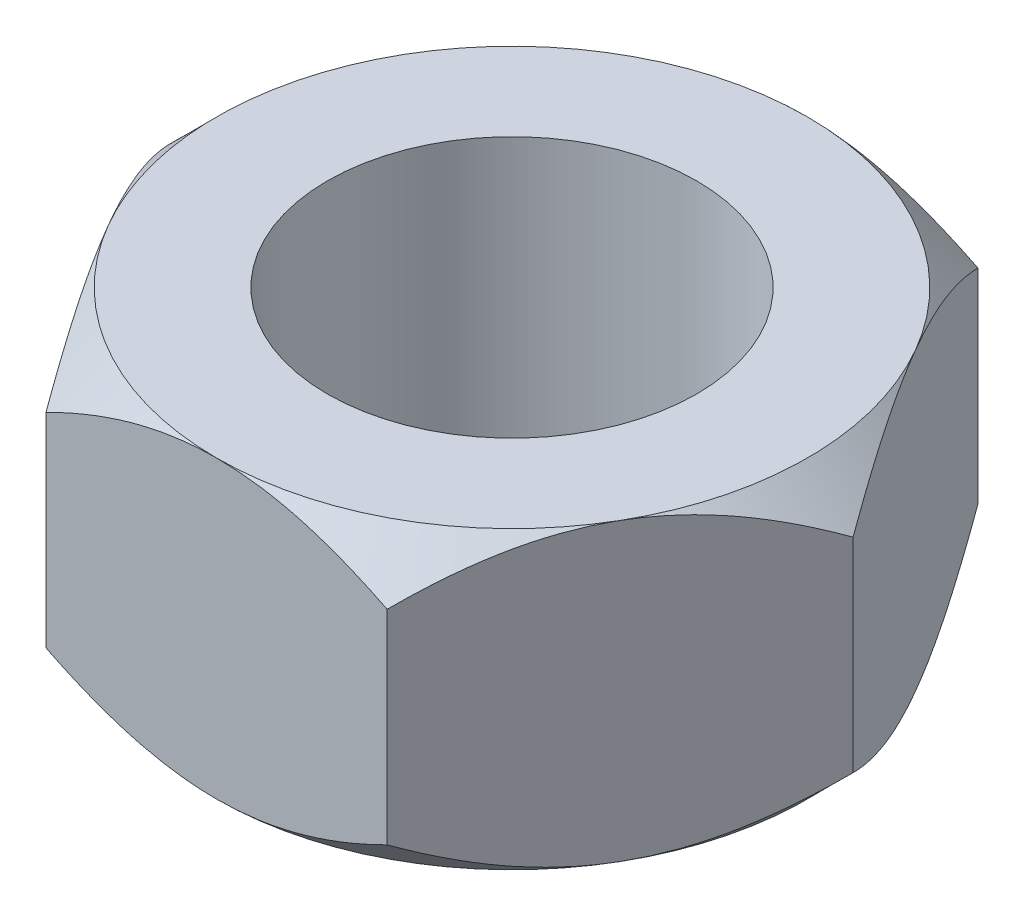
ISO-10303-21;
HEADER;
FILE_DESCRIPTION(('STEP AP214'),'2;1');
FILE_NAME('part.step','',(''),(''),'','','');
FILE_SCHEMA(('AUTOMOTIVE_DESIGN { 1 0 10303 214 1 1 1 1 }'));
ENDSEC;
DATA;
#1=APPLICATION_CONTEXT('core data for automotive mechanical design processes');
#2=APPLICATION_PROTOCOL_DEFINITION('international standard','automotive_design',2000,#1);
#3=PRODUCT_CONTEXT('',#1,'mechanical');
#4=PRODUCT('Part','Part','',(#3));
#5=PRODUCT_RELATED_PRODUCT_CATEGORY('part','',(#4));
#6=PRODUCT_DEFINITION_FORMATION('','',#4);
#7=PRODUCT_DEFINITION_CONTEXT('part definition',#1,'design');
#8=PRODUCT_DEFINITION('design','',#6,#7);
#9=PRODUCT_DEFINITION_SHAPE('','',#8);
#10=(LENGTH_UNIT() NAMED_UNIT(*) SI_UNIT(.MILLI.,.METRE.));
#11=(NAMED_UNIT(*) PLANE_ANGLE_UNIT() SI_UNIT($,.RADIAN.));
#12=(NAMED_UNIT(*) SI_UNIT($,.STERADIAN.) SOLID_ANGLE_UNIT());
#13=UNCERTAINTY_MEASURE_WITH_UNIT(LENGTH_MEASURE(1.E-05),#10,'distance_accuracy_value','');
#14=(GEOMETRIC_REPRESENTATION_CONTEXT(3) GLOBAL_UNCERTAINTY_ASSIGNED_CONTEXT((#13)) GLOBAL_UNIT_ASSIGNED_CONTEXT((#10,
#11,#12)) REPRESENTATION_CONTEXT('',''));
#15=CARTESIAN_POINT('',(0.,0.,0.));
#16=DIRECTION('',(0.,0.,1.));
#17=DIRECTION('',(1.,0.,0.));
#18=AXIS2_PLACEMENT_3D('',#15,#16,#17);
#19=CARTESIAN_POINT('',(4.61880215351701,4.,0.));
#20=DIRECTION('',(0.,-1.,0.));
#21=DIRECTION('',(0.,0.,-1.));
#22=AXIS2_PLACEMENT_3D('',#19,#20,#21);
#23=PLANE('',#22);
#24=CARTESIAN_POINT('',(0.,4.,0.));
#25=DIRECTION('',(0.,1.,0.));
#26=DIRECTION('',(0.,0.,1.));
#27=AXIS2_PLACEMENT_3D('',#24,#25,#26);
#28=CIRCLE('',#27,4.);
#29=CARTESIAN_POINT('',(3.46410161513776,4.,-2.));
#30=VERTEX_POINT('',#29);
#31=CARTESIAN_POINT('',(0.,4.,-4.));
#32=VERTEX_POINT('',#31);
#33=EDGE_CURVE('E291',#30,#32,#28,.T.);
#34=ORIENTED_EDGE('',*,*,#33,.T.);
#35=CARTESIAN_POINT('',(-3.46410161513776,4.,-2.));
#36=VERTEX_POINT('',#35);
#37=EDGE_CURVE('E295',#32,#36,#28,.T.);
#38=ORIENTED_EDGE('',*,*,#37,.T.);
#39=CARTESIAN_POINT('',(-3.46410161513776,4.,2.));
#40=VERTEX_POINT('',#39);
#41=EDGE_CURVE('E292',#36,#40,#28,.T.);
#42=ORIENTED_EDGE('',*,*,#41,.T.);
#43=CARTESIAN_POINT('',(0.,4.,4.));
#44=VERTEX_POINT('',#43);
#45=EDGE_CURVE('E156',#40,#44,#28,.T.);
#46=ORIENTED_EDGE('',*,*,#45,.T.);
#47=CARTESIAN_POINT('',(3.46410161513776,4.,2.));
#48=VERTEX_POINT('',#47);
#49=EDGE_CURVE('E283',#44,#48,#28,.T.);
#50=ORIENTED_EDGE('',*,*,#49,.T.);
#51=EDGE_CURVE('E285',#48,#30,#28,.T.);
#52=ORIENTED_EDGE('',*,*,#51,.T.);
#53=EDGE_LOOP('',(#34,#38,#42,#46,#50,#52));
#54=FACE_BOUND('',#53,.T.);
#55=CARTESIAN_POINT('',(0.,4.,0.));
#56=DIRECTION('',(0.,1.,0.));
#57=DIRECTION('',(0.,0.,1.));
#58=AXIS2_PLACEMENT_3D('',#55,#56,#57);
#59=CIRCLE('',#58,2.5);
#60=CARTESIAN_POINT('',(0.,4.,2.5));
#61=VERTEX_POINT('',#60);
#62=EDGE_CURVE('E186',#61,#61,#59,.T.);
#63=ORIENTED_EDGE('',*,*,#62,.F.);
#64=EDGE_LOOP('',(#63));
#65=FACE_BOUND('',#64,.T.);
#66=ADVANCED_FACE('F36',(#54,#65),#23,.F.);
#67=CARTESIAN_POINT('',(4.61880215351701,0.,0.));
#68=DIRECTION('',(0.,-1.,0.));
#69=DIRECTION('',(0.,0.,-1.));
#70=AXIS2_PLACEMENT_3D('',#67,#68,#69);
#71=PLANE('',#70);
#72=CARTESIAN_POINT('',(0.,0.,0.));
#73=DIRECTION('',(0.,-1.,0.));
#74=DIRECTION('',(0.,0.,-1.));
#75=AXIS2_PLACEMENT_3D('',#72,#73,#74);
#76=CIRCLE('',#75,4.00000000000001);
#77=CARTESIAN_POINT('',(-3.46410161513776,0.,-2.));
#78=VERTEX_POINT('',#77);
#79=CARTESIAN_POINT('',(0.,0.,-4.));
#80=VERTEX_POINT('',#79);
#81=EDGE_CURVE('E160',#78,#80,#76,.T.);
#82=ORIENTED_EDGE('',*,*,#81,.T.);
#83=CARTESIAN_POINT('',(3.46410161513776,0.,-2.));
#84=VERTEX_POINT('',#83);
#85=EDGE_CURVE('E138',#80,#84,#76,.T.);
#86=ORIENTED_EDGE('',*,*,#85,.T.);
#87=CARTESIAN_POINT('',(3.46410161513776,0.,2.));
#88=VERTEX_POINT('',#87);
#89=EDGE_CURVE('E129',#84,#88,#76,.T.);
#90=ORIENTED_EDGE('',*,*,#89,.T.);
#91=CARTESIAN_POINT('',(0.,0.,4.));
#92=VERTEX_POINT('',#91);
#93=EDGE_CURVE('E139',#88,#92,#76,.T.);
#94=ORIENTED_EDGE('',*,*,#93,.T.);
#95=CARTESIAN_POINT('',(-3.46410161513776,0.,2.));
#96=VERTEX_POINT('',#95);
#97=EDGE_CURVE('E166',#92,#96,#76,.T.);
#98=ORIENTED_EDGE('',*,*,#97,.T.);
#99=EDGE_CURVE('E165',#96,#78,#76,.T.);
#100=ORIENTED_EDGE('',*,*,#99,.T.);
#101=EDGE_LOOP('',(#82,#86,#90,#94,#98,#100));
#102=FACE_BOUND('',#101,.T.);
#103=CARTESIAN_POINT('',(0.,0.,0.));
#104=DIRECTION('',(0.,1.,0.));
#105=DIRECTION('',(0.,0.,1.));
#106=AXIS2_PLACEMENT_3D('',#103,#104,#105);
#107=CIRCLE('',#106,2.5);
#108=CARTESIAN_POINT('',(0.,0.,2.5));
#109=VERTEX_POINT('',#108);
#110=EDGE_CURVE('E191',#109,#109,#107,.T.);
#111=ORIENTED_EDGE('',*,*,#110,.T.);
#112=EDGE_LOOP('',(#111));
#113=FACE_BOUND('',#112,.T.);
#114=ADVANCED_FACE('F157',(#102,#113),#71,.T.);
#115=CARTESIAN_POINT('',(4.61880215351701,4.,0.));
#116=DIRECTION('',(0.866025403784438,0.,0.500000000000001));
#117=DIRECTION('',(0.500000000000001,0.,-0.866025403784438));
#118=AXIS2_PLACEMENT_3D('',#115,#116,#117);
#119=PLANE('',#118);
#120=DIRECTION('',(0.,-1.,0.));
#121=VECTOR('',#120,1.);
#122=CARTESIAN_POINT('',(2.30940107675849,4.,4.));
#123=LINE('',#122,#121);
#124=CARTESIAN_POINT('',(2.30940107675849,3.381197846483,4.));
#125=VERTEX_POINT('',#124);
#126=CARTESIAN_POINT('',(2.30940107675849,0.618802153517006,4.));
#127=VERTEX_POINT('',#126);
#128=EDGE_CURVE('E178',#125,#127,#123,.T.);
#129=ORIENTED_EDGE('',*,*,#128,.T.);
#130=CARTESIAN_POINT('',(2.30928560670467,0.618917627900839,4.00020000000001));
#131=CARTESIAN_POINT('',(2.34899632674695,0.579211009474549,3.93141901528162));
#132=CARTESIAN_POINT('',(2.3890109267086,0.540722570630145,3.8621116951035));
#133=CARTESIAN_POINT('',(2.46971048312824,0.466553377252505,3.72233596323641));
#134=CARTESIAN_POINT('',(2.51039579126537,0.430874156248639,3.6518669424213));
#135=CARTESIAN_POINT('',(2.63392971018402,0.32830302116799,3.4378999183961));
#136=CARTESIAN_POINT('',(2.71782823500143,0.266315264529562,3.29258341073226));
#137=CARTESIAN_POINT('',(2.88698352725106,0.160158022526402,2.99959785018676));
#138=CARTESIAN_POINT('',(2.97219756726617,0.11572120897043,2.85200280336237));
#139=CARTESIAN_POINT('',(3.14450730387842,0.0472511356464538,2.55355358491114));
#140=CARTESIAN_POINT('',(3.23159772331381,0.0231667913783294,2.40270855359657));
#141=CARTESIAN_POINT('',(3.38169462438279,0.00143703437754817,2.14273309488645));
#142=CARTESIAN_POINT('',(3.44450772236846,-0.00177893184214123,2.03393761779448));
#143=CARTESIAN_POINT('',(3.57003196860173,0.00364221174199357,1.81652324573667));
#144=CARTESIAN_POINT('',(3.63274307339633,0.0122834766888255,1.70790442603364));
#145=CARTESIAN_POINT('',(3.75757108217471,0.040926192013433,1.49169597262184));
#146=CARTESIAN_POINT('',(3.81968724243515,0.0609403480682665,1.38410762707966));
#147=CARTESIAN_POINT('',(3.94285275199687,0.111236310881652,1.17077870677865));
#148=CARTESIAN_POINT('',(4.00390218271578,0.141517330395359,1.06503799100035));
#149=CARTESIAN_POINT('',(4.11227961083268,0.20381740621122,0.877322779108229));
#150=CARTESIAN_POINT('',(4.1598475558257,0.234198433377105,0.794932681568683));
#151=CARTESIAN_POINT('',(4.25412951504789,0.299856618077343,0.631631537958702));
#152=CARTESIAN_POINT('',(4.30084350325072,0.335133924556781,0.550720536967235));
#153=CARTESIAN_POINT('',(4.39327037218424,0.409793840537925,0.390632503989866));
#154=CARTESIAN_POINT('',(4.43898588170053,0.449163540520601,0.311450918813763));
#155=CARTESIAN_POINT('',(4.52957030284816,0.531491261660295,0.154554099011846));
#156=CARTESIAN_POINT('',(4.57443971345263,0.574447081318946,0.0768380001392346));
#157=CARTESIAN_POINT('',(4.61891762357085,0.618917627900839,-0.000200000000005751));
#158=B_SPLINE_CURVE_WITH_KNOTS('',3,(#130,#131,#132,#133,#134,#135,#136,#137,#138,#139,#140,
#141,#142,#143,#144,#145,#146,#147,#148,#149,#150,#151,#152,#153,#154,#155,#156,#157),
.UNSPECIFIED.,.F.,.F.,(4,2,2,2,2,2,2,2,2,2,2,2,2,4),(0.,0.266361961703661,0.532868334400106,
1.06875865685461,1.59613884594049,2.12219135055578,2.49866160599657,2.87526382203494,
3.25228760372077,3.62928248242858,3.92874944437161,4.22822551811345,4.52678401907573,
4.82516056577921),.UNSPECIFIED.);
#159=EDGE_CURVE('E163',#127,#88,#158,.T.);
#160=ORIENTED_EDGE('',*,*,#159,.T.);
#161=CARTESIAN_POINT('',(4.61880215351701,0.618802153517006,0.));
#162=VERTEX_POINT('',#161);
#163=EDGE_CURVE('E57',#88,#162,#158,.T.);
#164=ORIENTED_EDGE('',*,*,#163,.T.);
#165=DIRECTION('',(0.,-1.,0.));
#166=VECTOR('',#165,1.);
#167=CARTESIAN_POINT('',(4.61880215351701,4.,0.));
#168=LINE('',#167,#166);
#169=CARTESIAN_POINT('',(4.61880215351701,3.381197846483,0.));
#170=VERTEX_POINT('',#169);
#171=EDGE_CURVE('E155',#170,#162,#168,.T.);
#172=ORIENTED_EDGE('',*,*,#171,.F.);
#173=CARTESIAN_POINT('',(4.61891762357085,3.38108237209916,-0.000200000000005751));
#174=CARTESIAN_POINT('',(4.57920690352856,3.42078899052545,0.0685809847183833));
#175=CARTESIAN_POINT('',(4.53919230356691,3.45927742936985,0.137888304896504));
#176=CARTESIAN_POINT('',(4.45849274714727,3.53344662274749,0.277664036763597));
#177=CARTESIAN_POINT('',(4.41780743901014,3.56912584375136,0.348133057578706));
#178=CARTESIAN_POINT('',(4.29427352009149,3.67169697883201,0.5621000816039));
#179=CARTESIAN_POINT('',(4.21037499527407,3.73368473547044,0.70741658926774));
#180=CARTESIAN_POINT('',(4.04121970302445,3.8398419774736,1.00040214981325));
#181=CARTESIAN_POINT('',(3.95600566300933,3.88427879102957,1.14799719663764));
#182=CARTESIAN_POINT('',(3.78369592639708,3.95274886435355,1.44644641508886));
#183=CARTESIAN_POINT('',(3.6966055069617,3.97683320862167,1.59729144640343));
#184=CARTESIAN_POINT('',(3.54650860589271,3.99856296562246,1.85726690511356));
#185=CARTESIAN_POINT('',(3.48369550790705,4.00177893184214,1.96606238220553));
#186=CARTESIAN_POINT('',(3.35817126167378,3.99635778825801,2.18347675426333));
#187=CARTESIAN_POINT('',(3.29546015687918,3.98771652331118,2.29209557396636));
#188=CARTESIAN_POINT('',(3.1706321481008,3.95907380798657,2.50830402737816));
#189=CARTESIAN_POINT('',(3.10851598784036,3.93905965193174,2.61589237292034));
#190=CARTESIAN_POINT('',(2.98535047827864,3.88876368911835,2.82922129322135));
#191=CARTESIAN_POINT('',(2.92430104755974,3.85848266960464,2.93496200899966));
#192=CARTESIAN_POINT('',(2.81592361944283,3.79618259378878,3.12267722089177));
#193=CARTESIAN_POINT('',(2.76835567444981,3.7658015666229,3.20506731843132));
#194=CARTESIAN_POINT('',(2.67407371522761,3.70014338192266,3.3683684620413));
#195=CARTESIAN_POINT('',(2.62735972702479,3.66486607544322,3.44927946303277));
#196=CARTESIAN_POINT('',(2.53493285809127,3.59020615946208,3.60936749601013));
#197=CARTESIAN_POINT('',(2.48921734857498,3.55083645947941,3.68854908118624));
#198=CARTESIAN_POINT('',(2.39863292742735,3.46850873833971,3.84544590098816));
#199=CARTESIAN_POINT('',(2.35376351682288,3.42555291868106,3.92316199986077));
#200=CARTESIAN_POINT('',(2.30928560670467,3.38108237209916,4.00020000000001));
#201=B_SPLINE_CURVE_WITH_KNOTS('',3,(#173,#174,#175,#176,#177,#178,#179,#180,#181,#182,#183,
#184,#185,#186,#187,#188,#189,#190,#191,#192,#193,#194,#195,#196,#197,#198,#199,#200),
.UNSPECIFIED.,.F.,.F.,(4,2,2,2,2,2,2,2,2,2,2,2,2,4),(0.,0.266361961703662,0.532868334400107,
1.06875865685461,1.59613884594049,2.12219135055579,2.49866160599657,2.87526382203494,
3.25228760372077,3.62928248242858,3.92874944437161,4.22822551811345,4.52678401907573,
4.82516056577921),.UNSPECIFIED.);
#202=EDGE_CURVE('E327',#170,#48,#201,.T.);
#203=ORIENTED_EDGE('',*,*,#202,.T.);
#204=EDGE_CURVE('E183',#48,#125,#201,.T.);
#205=ORIENTED_EDGE('',*,*,#204,.T.);
#206=EDGE_LOOP('',(#129,#160,#164,#172,#203,#205));
#207=FACE_BOUND('',#206,.T.);
#208=ADVANCED_FACE('F38',(#207),#119,.T.);
#209=CARTESIAN_POINT('',(4.61880215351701,4.,0.));
#210=DIRECTION('',(-0.866025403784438,0.,0.500000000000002));
#211=DIRECTION('',(0.500000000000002,0.,0.866025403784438));
#212=AXIS2_PLACEMENT_3D('',#209,#210,#211);
#213=PLANE('',#212);
#214=CARTESIAN_POINT('',(2.30928560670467,0.618917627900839,-4.00020000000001));
#215=CARTESIAN_POINT('',(2.34899632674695,0.579211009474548,-3.93141901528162));
#216=CARTESIAN_POINT('',(2.3890109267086,0.540722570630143,-3.8621116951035));
#217=CARTESIAN_POINT('',(2.46971048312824,0.466553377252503,-3.72233596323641));
#218=CARTESIAN_POINT('',(2.51039579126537,0.430874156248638,-3.6518669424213));
#219=CARTESIAN_POINT('',(2.63392971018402,0.328303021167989,-3.4378999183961));
#220=CARTESIAN_POINT('',(2.71782823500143,0.266315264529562,-3.29258341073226));
#221=CARTESIAN_POINT('',(2.88698352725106,0.160158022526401,-2.99959785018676));
#222=CARTESIAN_POINT('',(2.97219756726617,0.115721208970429,-2.85200280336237));
#223=CARTESIAN_POINT('',(3.14450730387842,0.047251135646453,-2.55355358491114));
#224=CARTESIAN_POINT('',(3.23159772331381,0.0231667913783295,-2.40270855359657));
#225=CARTESIAN_POINT('',(3.38169462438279,0.00143703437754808,-2.14273309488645));
#226=CARTESIAN_POINT('',(3.44450772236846,-0.00177893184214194,-2.03393761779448));
#227=CARTESIAN_POINT('',(3.57003196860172,0.00364221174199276,-1.81652324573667));
#228=CARTESIAN_POINT('',(3.63274307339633,0.0122834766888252,-1.70790442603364));
#229=CARTESIAN_POINT('',(3.75757108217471,0.0409261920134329,-1.49169597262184));
#230=CARTESIAN_POINT('',(3.81968724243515,0.0609403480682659,-1.38410762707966));
#231=CARTESIAN_POINT('',(3.94285275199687,0.111236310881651,-1.17077870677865));
#232=CARTESIAN_POINT('',(4.00390218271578,0.141517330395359,-1.06503799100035));
#233=CARTESIAN_POINT('',(4.11227961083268,0.20381740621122,-0.877322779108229));
#234=CARTESIAN_POINT('',(4.1598475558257,0.234198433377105,-0.794932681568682));
#235=CARTESIAN_POINT('',(4.25412951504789,0.299856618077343,-0.631631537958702));
#236=CARTESIAN_POINT('',(4.30084350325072,0.335133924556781,-0.550720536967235));
#237=CARTESIAN_POINT('',(4.39327037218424,0.409793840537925,-0.390632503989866));
#238=CARTESIAN_POINT('',(4.43898588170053,0.449163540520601,-0.311450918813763));
#239=CARTESIAN_POINT('',(4.52957030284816,0.531491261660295,-0.154554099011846));
#240=CARTESIAN_POINT('',(4.57443971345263,0.574447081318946,-0.0768380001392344));
#241=CARTESIAN_POINT('',(4.61891762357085,0.618917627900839,0.000200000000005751));
#242=B_SPLINE_CURVE_WITH_KNOTS('',3,(#214,#215,#216,#217,#218,#219,#220,#221,#222,#223,#224,
#225,#226,#227,#228,#229,#230,#231,#232,#233,#234,#235,#236,#237,#238,#239,#240,#241),
.UNSPECIFIED.,.F.,.F.,(4,2,2,2,2,2,2,2,2,2,2,2,2,4),(0.,0.266361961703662,0.532868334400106,
1.06875865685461,1.59613884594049,2.12219135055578,2.49866160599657,2.87526382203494,
3.25228760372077,3.62928248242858,3.92874944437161,4.22822551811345,4.52678401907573,
4.82516056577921),.UNSPECIFIED.);
#243=CARTESIAN_POINT('',(2.30940107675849,0.618802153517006,-4.));
#244=VERTEX_POINT('',#243);
#245=EDGE_CURVE('E144',#244,#84,#242,.T.);
#246=ORIENTED_EDGE('',*,*,#245,.F.);
#247=DIRECTION('',(0.,-1.,0.));
#248=VECTOR('',#247,1.);
#249=CARTESIAN_POINT('',(2.30940107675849,4.,-4.));
#250=LINE('',#249,#248);
#251=CARTESIAN_POINT('',(2.30940107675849,3.381197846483,-4.));
#252=VERTEX_POINT('',#251);
#253=EDGE_CURVE('E317',#252,#244,#250,.T.);
#254=ORIENTED_EDGE('',*,*,#253,.F.);
#255=CARTESIAN_POINT('',(4.61891762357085,3.38108237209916,0.000200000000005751));
#256=CARTESIAN_POINT('',(4.57920690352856,3.42078899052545,-0.0685809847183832));
#257=CARTESIAN_POINT('',(4.53919230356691,3.45927742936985,-0.137888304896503));
#258=CARTESIAN_POINT('',(4.45849274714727,3.53344662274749,-0.277664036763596));
#259=CARTESIAN_POINT('',(4.41780743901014,3.56912584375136,-0.348133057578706));
#260=CARTESIAN_POINT('',(4.29427352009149,3.67169697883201,-0.5621000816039));
#261=CARTESIAN_POINT('',(4.21037499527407,3.73368473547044,-0.70741658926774));
#262=CARTESIAN_POINT('',(4.04121970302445,3.8398419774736,-1.00040214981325));
#263=CARTESIAN_POINT('',(3.95600566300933,3.88427879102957,-1.14799719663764));
#264=CARTESIAN_POINT('',(3.78369592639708,3.95274886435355,-1.44644641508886));
#265=CARTESIAN_POINT('',(3.6966055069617,3.97683320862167,-1.59729144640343));
#266=CARTESIAN_POINT('',(3.54650860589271,3.99856296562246,-1.85726690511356));
#267=CARTESIAN_POINT('',(3.48369550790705,4.00177893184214,-1.96606238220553));
#268=CARTESIAN_POINT('',(3.35817126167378,3.99635778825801,-2.18347675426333));
#269=CARTESIAN_POINT('',(3.29546015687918,3.98771652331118,-2.29209557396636));
#270=CARTESIAN_POINT('',(3.1706321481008,3.95907380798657,-2.50830402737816));
#271=CARTESIAN_POINT('',(3.10851598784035,3.93905965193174,-2.61589237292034));
#272=CARTESIAN_POINT('',(2.98535047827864,3.88876368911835,-2.82922129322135));
#273=CARTESIAN_POINT('',(2.92430104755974,3.85848266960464,-2.93496200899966));
#274=CARTESIAN_POINT('',(2.81592361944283,3.79618259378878,-3.12267722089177));
#275=CARTESIAN_POINT('',(2.76835567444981,3.7658015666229,-3.20506731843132));
#276=CARTESIAN_POINT('',(2.67407371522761,3.70014338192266,-3.3683684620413));
#277=CARTESIAN_POINT('',(2.62735972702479,3.66486607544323,-3.44927946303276));
#278=CARTESIAN_POINT('',(2.53493285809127,3.59020615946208,-3.60936749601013));
#279=CARTESIAN_POINT('',(2.48921734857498,3.55083645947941,-3.68854908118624));
#280=CARTESIAN_POINT('',(2.39863292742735,3.46850873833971,-3.84544590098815));
#281=CARTESIAN_POINT('',(2.35376351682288,3.42555291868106,-3.92316199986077));
#282=CARTESIAN_POINT('',(2.30928560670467,3.38108237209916,-4.00020000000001));
#283=B_SPLINE_CURVE_WITH_KNOTS('',3,(#255,#256,#257,#258,#259,#260,#261,#262,#263,#264,#265,
#266,#267,#268,#269,#270,#271,#272,#273,#274,#275,#276,#277,#278,#279,#280,#281,#282),
.UNSPECIFIED.,.F.,.F.,(4,2,2,2,2,2,2,2,2,2,2,2,2,4),(0.,0.266361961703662,0.532868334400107,
1.06875865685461,1.59613884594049,2.12219135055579,2.49866160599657,2.87526382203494,
3.25228760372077,3.62928248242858,3.92874944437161,4.22822551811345,4.52678401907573,
4.82516056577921),.UNSPECIFIED.);
#284=EDGE_CURVE('E310',#30,#252,#283,.T.);
#285=ORIENTED_EDGE('',*,*,#284,.F.);
#286=EDGE_CURVE('E247',#170,#30,#283,.T.);
#287=ORIENTED_EDGE('',*,*,#286,.F.);
#288=ORIENTED_EDGE('',*,*,#171,.T.);
#289=EDGE_CURVE('E133',#84,#162,#242,.T.);
#290=ORIENTED_EDGE('',*,*,#289,.F.);
#291=EDGE_LOOP('',(#246,#254,#285,#287,#288,#290));
#292=FACE_BOUND('',#291,.T.);
#293=ADVANCED_FACE('F153',(#292),#213,.F.);
#294=CARTESIAN_POINT('',(-2.30940107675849,4.,-4.));
#295=DIRECTION('',(0.,0.,-1.));
#296=DIRECTION('',(-1.,0.,0.));
#297=AXIS2_PLACEMENT_3D('',#294,#295,#296);
#298=PLANE('',#297);
#299=ORIENTED_EDGE('',*,*,#253,.T.);
#300=CARTESIAN_POINT('',(-5.62739378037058,2.9041698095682,-4.));
#301=CARTESIAN_POINT('',(-5.48567305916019,2.78868679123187,-4.));
#302=CARTESIAN_POINT('',(-5.34325635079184,2.67404423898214,-4.));
#303=CARTESIAN_POINT('',(-5.05668167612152,2.44688221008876,-4.));
#304=CARTESIAN_POINT('',(-4.91252327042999,2.33436328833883,-4.));
#305=CARTESIAN_POINT('',(-4.62060451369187,2.11073714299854,-4.));
#306=CARTESIAN_POINT('',(-4.47282202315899,1.99965872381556,-4.));
#307=CARTESIAN_POINT('',(-4.1747891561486,1.780883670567,-4.));
#308=CARTESIAN_POINT('',(-4.0245390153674,1.67318671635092,-4.));
#309=CARTESIAN_POINT('',(-3.70745510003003,1.45262266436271,-4.));
#310=CARTESIAN_POINT('',(-3.54034108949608,1.34015614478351,-4.));
#311=CARTESIAN_POINT('',(-3.20168901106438,1.12191677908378,-4.));
#312=CARTESIAN_POINT('',(-3.03014957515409,1.01614603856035,-4.));
#313=CARTESIAN_POINT('',(-2.68253937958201,0.814154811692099,-4.));
#314=CARTESIAN_POINT('',(-2.50649297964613,0.717892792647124,-4.));
#315=CARTESIAN_POINT('',(-2.14824323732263,0.537730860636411,-4.));
#316=CARTESIAN_POINT('',(-1.9660452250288,0.453820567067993,-4.));
#317=CARTESIAN_POINT('',(-1.64622345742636,0.323778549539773,-4.));
#318=CARTESIAN_POINT('',(-1.51024779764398,0.273622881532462,-4.));
#319=CARTESIAN_POINT('',(-1.23468247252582,0.184192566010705,-4.));
#320=CARTESIAN_POINT('',(-1.09509231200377,0.14491941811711,-4.));
#321=CARTESIAN_POINT('',(-0.815895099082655,0.0801558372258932,-4.));
#322=CARTESIAN_POINT('',(-0.676354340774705,0.0543844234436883,-4.));
#323=CARTESIAN_POINT('',(-0.395369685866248,0.0170833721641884,-4.));
#324=CARTESIAN_POINT('',(-0.25392622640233,0.0055505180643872,-4.));
#325=CARTESIAN_POINT('',(0.0224344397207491,-0.00220491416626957,-4.));
#326=CARTESIAN_POINT('',(0.157331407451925,0.000849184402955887,-4.));
#327=CARTESIAN_POINT('',(0.426139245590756,0.0203999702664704,-4.));
#328=CARTESIAN_POINT('',(0.560050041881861,0.0368976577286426,-4.));
#329=CARTESIAN_POINT('',(0.828249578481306,0.082669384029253,-4.));
#330=CARTESIAN_POINT('',(0.962497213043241,0.112180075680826,-4.));
#331=CARTESIAN_POINT('',(1.22800919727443,0.182295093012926,-4.));
#332=CARTESIAN_POINT('',(1.35927363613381,0.222899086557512,-4.));
#333=CARTESIAN_POINT('',(1.62314822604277,0.31494728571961,-4.));
#334=CARTESIAN_POINT('',(1.75564045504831,0.366725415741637,-4.));
#335=CARTESIAN_POINT('',(2.01721504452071,0.478297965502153,-4.));
#336=CARTESIAN_POINT('',(2.14629632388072,0.538094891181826,-4.));
#337=CARTESIAN_POINT('',(2.40167335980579,0.664297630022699,-4.));
#338=CARTESIAN_POINT('',(2.52795890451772,0.730723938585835,-4.));
#339=CARTESIAN_POINT('',(2.77764203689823,0.868724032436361,-4.));
#340=CARTESIAN_POINT('',(2.9010400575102,0.94029703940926,-4.));
#341=CARTESIAN_POINT('',(3.13927957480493,1.08394545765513,-4.));
#342=CARTESIAN_POINT('',(3.25424234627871,1.15582080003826,-4.));
#343=CARTESIAN_POINT('',(3.4821925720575,1.30264731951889,-4.));
#344=CARTESIAN_POINT('',(3.59517987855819,1.377598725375,-4.));
#345=CARTESIAN_POINT('',(3.81853437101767,1.52942464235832,-4.));
#346=CARTESIAN_POINT('',(3.92891526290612,1.60627906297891,-4.));
#347=CARTESIAN_POINT('',(4.14816043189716,1.76206082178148,-4.));
#348=CARTESIAN_POINT('',(4.25702511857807,1.8409875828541,-4.));
#349=CARTESIAN_POINT('',(4.36525322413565,1.9207631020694,-4.));
#350=B_SPLINE_CURVE_WITH_KNOTS('',3,(#300,#301,#302,#303,#304,#305,#306,#307,#308,#309,#310,
#311,#312,#313,#314,#315,#316,#317,#318,#319,#320,#321,#322,#323,#324,#325,#326,#327,#328,#329,
#330,#331,#332,#333,#334,#335,#336,#337,#338,#339,#340,#341,#342,#343,#344,#345,#346,#347,#348,
#349),.UNSPECIFIED.,.F.,.F.,(4,2,2,2,2,2,2,2,2,2,2,2,2,2,2,2,2,2,2,2,2,2,2,2,4),(0.,
0.548452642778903,1.09704666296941,1.65162724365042,2.20615515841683,2.81033793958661,
3.41470978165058,4.01631281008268,4.61740731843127,5.05183569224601,5.48632390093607,
5.91136971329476,6.33631948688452,6.74042244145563,7.14455546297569,7.55636228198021,
7.9681567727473,8.39458384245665,8.82114448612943,9.24906733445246,9.67692560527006,
10.0836145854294,10.4903338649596,10.8938112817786,11.2971775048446),.UNSPECIFIED.);
#351=EDGE_CURVE('E147',#244,#80,#350,.F.);
#352=ORIENTED_EDGE('',*,*,#351,.T.);
#353=CARTESIAN_POINT('',(-2.30940107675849,0.618802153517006,-4.));
#354=VERTEX_POINT('',#353);
#355=EDGE_CURVE('E265',#80,#354,#350,.F.);
#356=ORIENTED_EDGE('',*,*,#355,.T.);
#357=DIRECTION('',(0.,-1.,0.));
#358=VECTOR('',#357,1.);
#359=CARTESIAN_POINT('',(-2.30940107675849,4.,-4.));
#360=LINE('',#359,#358);
#361=CARTESIAN_POINT('',(-2.30940107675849,3.381197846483,-4.));
#362=VERTEX_POINT('',#361);
#363=EDGE_CURVE('E313',#362,#354,#360,.T.);
#364=ORIENTED_EDGE('',*,*,#363,.F.);
#365=CARTESIAN_POINT('',(-5.62739378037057,1.0958301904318,-4.));
#366=CARTESIAN_POINT('',(-5.48567305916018,1.21131320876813,-4.));
#367=CARTESIAN_POINT('',(-5.34325635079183,1.32595576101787,-4.));
#368=CARTESIAN_POINT('',(-5.05668167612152,1.55311778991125,-4.));
#369=CARTESIAN_POINT('',(-4.91252327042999,1.66563671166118,-4.));
#370=CARTESIAN_POINT('',(-4.62060451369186,1.88926285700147,-4.));
#371=CARTESIAN_POINT('',(-4.47282202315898,2.00034127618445,-4.));
#372=CARTESIAN_POINT('',(-4.1747891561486,2.21911632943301,-4.));
#373=CARTESIAN_POINT('',(-4.02453901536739,2.32681328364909,-4.));
#374=CARTESIAN_POINT('',(-3.70745510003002,2.54737733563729,-4.));
#375=CARTESIAN_POINT('',(-3.54034108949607,2.65984385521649,-4.));
#376=CARTESIAN_POINT('',(-3.20168901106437,2.87808322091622,-4.));
#377=CARTESIAN_POINT('',(-3.03014957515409,2.98385396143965,-4.));
#378=CARTESIAN_POINT('',(-2.68253937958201,3.18584518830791,-4.));
#379=CARTESIAN_POINT('',(-2.50649297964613,3.28210720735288,-4.));
#380=CARTESIAN_POINT('',(-2.14824323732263,3.46226913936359,-4.));
#381=CARTESIAN_POINT('',(-1.9660452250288,3.54617943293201,-4.));
#382=CARTESIAN_POINT('',(-1.64622345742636,3.67622145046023,-4.));
#383=CARTESIAN_POINT('',(-1.51024779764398,3.72637711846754,-4.));
#384=CARTESIAN_POINT('',(-1.23468247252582,3.8158074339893,-4.));
#385=CARTESIAN_POINT('',(-1.09509231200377,3.85508058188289,-4.));
#386=CARTESIAN_POINT('',(-0.815895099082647,3.91984416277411,-4.));
#387=CARTESIAN_POINT('',(-0.676354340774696,3.94561557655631,-4.));
#388=CARTESIAN_POINT('',(-0.395369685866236,3.98291662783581,-4.));
#389=CARTESIAN_POINT('',(-0.253926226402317,3.99444948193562,-4.));
#390=CARTESIAN_POINT('',(0.0224344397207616,4.00220491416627,-4.));
#391=CARTESIAN_POINT('',(0.157331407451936,3.99915081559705,-4.));
#392=CARTESIAN_POINT('',(0.426139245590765,3.97960002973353,-4.));
#393=CARTESIAN_POINT('',(0.560050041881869,3.96310234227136,-4.));
#394=CARTESIAN_POINT('',(0.828249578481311,3.91733061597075,-4.));
#395=CARTESIAN_POINT('',(0.962497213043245,3.88781992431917,-4.));
#396=CARTESIAN_POINT('',(1.22800919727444,3.81770490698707,-4.));
#397=CARTESIAN_POINT('',(1.35927363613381,3.77710091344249,-4.));
#398=CARTESIAN_POINT('',(1.62314822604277,3.68505271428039,-4.));
#399=CARTESIAN_POINT('',(1.75564045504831,3.63327458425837,-4.));
#400=CARTESIAN_POINT('',(2.01721504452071,3.52170203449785,-4.));
#401=CARTESIAN_POINT('',(2.14629632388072,3.46190510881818,-4.));
#402=CARTESIAN_POINT('',(2.4016733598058,3.3357023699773,-4.));
#403=CARTESIAN_POINT('',(2.52795890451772,3.26927606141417,-4.));
#404=CARTESIAN_POINT('',(2.77764203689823,3.13127596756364,-4.));
#405=CARTESIAN_POINT('',(2.9010400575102,3.05970296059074,-4.));
#406=CARTESIAN_POINT('',(3.13927957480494,2.91605454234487,-4.));
#407=CARTESIAN_POINT('',(3.25424234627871,2.84417919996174,-4.));
#408=CARTESIAN_POINT('',(3.4821925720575,2.69735268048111,-4.));
#409=CARTESIAN_POINT('',(3.59517987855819,2.622401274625,-4.));
#410=CARTESIAN_POINT('',(3.81853437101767,2.47057535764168,-4.));
#411=CARTESIAN_POINT('',(3.92891526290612,2.39372093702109,-4.));
#412=CARTESIAN_POINT('',(4.14816043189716,2.23793917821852,-4.));
#413=CARTESIAN_POINT('',(4.25702511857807,2.1590124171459,-4.));
#414=CARTESIAN_POINT('',(4.36525322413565,2.0792368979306,-4.));
#415=B_SPLINE_CURVE_WITH_KNOTS('',3,(#365,#366,#367,#368,#369,#370,#371,#372,#373,#374,#375,
#376,#377,#378,#379,#380,#381,#382,#383,#384,#385,#386,#387,#388,#389,#390,#391,#392,#393,#394,
#395,#396,#397,#398,#399,#400,#401,#402,#403,#404,#405,#406,#407,#408,#409,#410,#411,#412,#413,
#414),.UNSPECIFIED.,.F.,.F.,(4,2,2,2,2,2,2,2,2,2,2,2,2,2,2,2,2,2,2,2,2,2,2,2,4),(0.,
0.548452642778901,1.09704666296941,1.65162724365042,2.20615515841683,2.8103379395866,
3.41470978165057,4.01631281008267,4.61740731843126,5.051835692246,5.48632390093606,
5.91136971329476,6.33631948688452,6.74042244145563,7.14455546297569,7.5563622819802,
7.96815677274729,8.39458384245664,8.82114448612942,9.24906733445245,9.67692560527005,
10.0836145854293,10.4903338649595,10.8938112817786,11.2971775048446),.UNSPECIFIED.);
#416=EDGE_CURVE('E240',#362,#32,#415,.T.);
#417=ORIENTED_EDGE('',*,*,#416,.T.);
#418=EDGE_CURVE('E249',#32,#252,#415,.T.);
#419=ORIENTED_EDGE('',*,*,#418,.T.);
#420=EDGE_LOOP('',(#299,#352,#356,#364,#417,#419));
#421=FACE_BOUND('',#420,.T.);
#422=ADVANCED_FACE('F255',(#421),#298,.T.);
#423=CARTESIAN_POINT('',(-4.618802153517,4.,0.));
#424=DIRECTION('',(-0.86602540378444,0.,-0.499999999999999));
#425=DIRECTION('',(-0.499999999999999,0.,0.86602540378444));
#426=AXIS2_PLACEMENT_3D('',#423,#424,#425);
#427=PLANE('',#426);
#428=ORIENTED_EDGE('',*,*,#363,.T.);
#429=CARTESIAN_POINT('',(-2.30928560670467,0.618917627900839,-4.00020000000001));
#430=CARTESIAN_POINT('',(-2.34899632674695,0.579211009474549,-3.93141901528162));
#431=CARTESIAN_POINT('',(-2.3890109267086,0.540722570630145,-3.8621116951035));
#432=CARTESIAN_POINT('',(-2.46971048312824,0.466553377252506,-3.72233596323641));
#433=CARTESIAN_POINT('',(-2.51039579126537,0.43087415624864,-3.6518669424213));
#434=CARTESIAN_POINT('',(-2.63392971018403,0.328303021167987,-3.4378999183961));
#435=CARTESIAN_POINT('',(-2.71782823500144,0.266315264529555,-3.29258341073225));
#436=CARTESIAN_POINT('',(-2.88698352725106,0.160158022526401,-2.99959785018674));
#437=CARTESIAN_POINT('',(-2.97219756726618,0.115721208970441,-2.85200280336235));
#438=CARTESIAN_POINT('',(-3.14450730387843,0.0472511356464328,-2.55355358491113));
#439=CARTESIAN_POINT('',(-3.23159772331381,0.0231667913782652,-2.40270855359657));
#440=CARTESIAN_POINT('',(-3.38169462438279,0.00143703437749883,-2.14273309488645));
#441=CARTESIAN_POINT('',(-3.44450772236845,-0.00177893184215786,-2.03393761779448));
#442=CARTESIAN_POINT('',(-3.57003196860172,0.00364221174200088,-1.81652324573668));
#443=CARTESIAN_POINT('',(-3.63274307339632,0.0122834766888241,-1.70790442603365));
#444=CARTESIAN_POINT('',(-3.7575710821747,0.0409261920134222,-1.49169597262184));
#445=CARTESIAN_POINT('',(-3.81968724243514,0.060940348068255,-1.38410762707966));
#446=CARTESIAN_POINT('',(-3.94285275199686,0.111236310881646,-1.17077870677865));
#447=CARTESIAN_POINT('',(-4.00390218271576,0.14151733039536,-1.06503799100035));
#448=CARTESIAN_POINT('',(-4.11227961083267,0.203817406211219,-0.877322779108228));
#449=CARTESIAN_POINT('',(-4.15984755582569,0.234198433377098,-0.794932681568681));
#450=CARTESIAN_POINT('',(-4.25412951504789,0.299856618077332,-0.631631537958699));
#451=CARTESIAN_POINT('',(-4.30084350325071,0.335133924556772,-0.550720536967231));
#452=CARTESIAN_POINT('',(-4.39327037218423,0.409793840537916,-0.390632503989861));
#453=CARTESIAN_POINT('',(-4.43898588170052,0.449163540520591,-0.311450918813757));
#454=CARTESIAN_POINT('',(-4.52957030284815,0.531491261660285,-0.154554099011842));
#455=CARTESIAN_POINT('',(-4.57443971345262,0.574447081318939,-0.0768380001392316));
#456=CARTESIAN_POINT('',(-4.61891762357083,0.618917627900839,0.000200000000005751));
#457=B_SPLINE_CURVE_WITH_KNOTS('',3,(#429,#430,#431,#432,#433,#434,#435,#436,#437,#438,#439,
#440,#441,#442,#443,#444,#445,#446,#447,#448,#449,#450,#451,#452,#453,#454,#455,#456),
.UNSPECIFIED.,.F.,.F.,(4,2,2,2,2,2,2,2,2,2,2,2,2,4),(0.,0.266361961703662,0.532868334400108,
1.06875865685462,1.59613884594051,2.12219135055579,2.49866160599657,2.87526382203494,
3.25228760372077,3.62928248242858,3.92874944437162,4.22822551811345,4.52678401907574,
4.82516056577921),.UNSPECIFIED.);
#458=EDGE_CURVE('E272',#354,#78,#457,.T.);
#459=ORIENTED_EDGE('',*,*,#458,.T.);
#460=CARTESIAN_POINT('',(-4.618802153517,0.618802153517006,0.));
#461=VERTEX_POINT('',#460);
#462=EDGE_CURVE('E273',#78,#461,#457,.T.);
#463=ORIENTED_EDGE('',*,*,#462,.T.);
#464=DIRECTION('',(0.,-1.,0.));
#465=VECTOR('',#464,1.);
#466=CARTESIAN_POINT('',(-4.618802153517,4.,0.));
#467=LINE('',#466,#465);
#468=CARTESIAN_POINT('',(-4.618802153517,3.381197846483,0.));
#469=VERTEX_POINT('',#468);
#470=EDGE_CURVE('E188',#469,#461,#467,.T.);
#471=ORIENTED_EDGE('',*,*,#470,.F.);
#472=CARTESIAN_POINT('',(-4.61891762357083,3.38108237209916,0.000200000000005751));
#473=CARTESIAN_POINT('',(-4.57920690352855,3.42078899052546,-0.0685809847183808));
#474=CARTESIAN_POINT('',(-4.5391923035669,3.45927742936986,-0.1378883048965));
#475=CARTESIAN_POINT('',(-4.45849274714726,3.53344662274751,-0.277664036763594));
#476=CARTESIAN_POINT('',(-4.41780743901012,3.56912584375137,-0.348133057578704));
#477=CARTESIAN_POINT('',(-4.29427352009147,3.67169697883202,-0.562100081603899));
#478=CARTESIAN_POINT('',(-4.21037499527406,3.73368473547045,-0.707416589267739));
#479=CARTESIAN_POINT('',(-4.04121970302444,3.83984197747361,-1.00040214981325));
#480=CARTESIAN_POINT('',(-3.95600566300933,3.88427879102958,-1.14799719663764));
#481=CARTESIAN_POINT('',(-3.78369592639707,3.95274886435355,-1.44644641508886));
#482=CARTESIAN_POINT('',(-3.69660550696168,3.97683320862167,-1.59729144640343));
#483=CARTESIAN_POINT('',(-3.5465086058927,3.99856296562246,-1.85726690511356));
#484=CARTESIAN_POINT('',(-3.48369550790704,4.00177893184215,-1.96606238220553));
#485=CARTESIAN_POINT('',(-3.35817126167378,3.99635778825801,-2.18347675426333));
#486=CARTESIAN_POINT('',(-3.29546015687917,3.98771652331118,-2.29209557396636));
#487=CARTESIAN_POINT('',(-3.1706321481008,3.95907380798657,-2.50830402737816));
#488=CARTESIAN_POINT('',(-3.10851598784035,3.93905965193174,-2.61589237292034));
#489=CARTESIAN_POINT('',(-2.98535047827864,3.88876368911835,-2.82922129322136));
#490=CARTESIAN_POINT('',(-2.92430104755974,3.85848266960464,-2.93496200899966));
#491=CARTESIAN_POINT('',(-2.81592361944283,3.79618259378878,-3.12267722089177));
#492=CARTESIAN_POINT('',(-2.76835567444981,3.7658015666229,-3.20506731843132));
#493=CARTESIAN_POINT('',(-2.67407371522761,3.70014338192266,-3.3683684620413));
#494=CARTESIAN_POINT('',(-2.62735972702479,3.66486607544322,-3.44927946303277));
#495=CARTESIAN_POINT('',(-2.53493285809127,3.59020615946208,-3.60936749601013));
#496=CARTESIAN_POINT('',(-2.48921734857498,3.5508364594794,-3.68854908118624));
#497=CARTESIAN_POINT('',(-2.39863292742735,3.46850873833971,-3.84544590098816));
#498=CARTESIAN_POINT('',(-2.35376351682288,3.42555291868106,-3.92316199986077));
#499=CARTESIAN_POINT('',(-2.30928560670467,3.38108237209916,-4.00020000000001));
#500=B_SPLINE_CURVE_WITH_KNOTS('',3,(#472,#473,#474,#475,#476,#477,#478,#479,#480,#481,#482,
#483,#484,#485,#486,#487,#488,#489,#490,#491,#492,#493,#494,#495,#496,#497,#498,#499),
.UNSPECIFIED.,.F.,.F.,(4,2,2,2,2,2,2,2,2,2,2,2,2,4),(0.,0.266361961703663,0.53286833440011,
1.06875865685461,1.5961388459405,2.12219135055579,2.49866160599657,2.87526382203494,
3.25228760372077,3.62928248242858,3.92874944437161,4.22822551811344,4.52678401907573,
4.82516056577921),.UNSPECIFIED.);
#501=EDGE_CURVE('E228',#469,#36,#500,.T.);
#502=ORIENTED_EDGE('',*,*,#501,.T.);
#503=EDGE_CURVE('E248',#36,#362,#500,.T.);
#504=ORIENTED_EDGE('',*,*,#503,.T.);
#505=EDGE_LOOP('',(#428,#459,#463,#471,#502,#504));
#506=FACE_BOUND('',#505,.T.);
#507=ADVANCED_FACE('F258',(#506),#427,.T.);
#508=CARTESIAN_POINT('',(-4.618802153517,4.,0.));
#509=DIRECTION('',(0.86602540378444,0.,-0.499999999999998));
#510=DIRECTION('',(-0.499999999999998,0.,-0.86602540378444));
#511=AXIS2_PLACEMENT_3D('',#508,#509,#510);
#512=PLANE('',#511);
#513=CARTESIAN_POINT('',(-2.30928560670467,0.618917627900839,4.00020000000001));
#514=CARTESIAN_POINT('',(-2.34899632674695,0.579211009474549,3.93141901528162));
#515=CARTESIAN_POINT('',(-2.3890109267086,0.540722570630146,3.8621116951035));
#516=CARTESIAN_POINT('',(-2.46971048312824,0.466553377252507,3.72233596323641));
#517=CARTESIAN_POINT('',(-2.51039579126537,0.430874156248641,3.6518669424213));
#518=CARTESIAN_POINT('',(-2.63392971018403,0.328303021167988,3.4378999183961));
#519=CARTESIAN_POINT('',(-2.71782823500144,0.266315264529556,3.29258341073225));
#520=CARTESIAN_POINT('',(-2.88698352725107,0.160158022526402,2.99959785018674));
#521=CARTESIAN_POINT('',(-2.97219756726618,0.115721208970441,2.85200280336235));
#522=CARTESIAN_POINT('',(-3.14450730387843,0.0472511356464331,2.55355358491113));
#523=CARTESIAN_POINT('',(-3.23159772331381,0.0231667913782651,2.40270855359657));
#524=CARTESIAN_POINT('',(-3.38169462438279,0.00143703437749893,2.14273309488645));
#525=CARTESIAN_POINT('',(-3.44450772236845,-0.0017789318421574,2.03393761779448));
#526=CARTESIAN_POINT('',(-3.57003196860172,0.00364221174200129,1.81652324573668));
#527=CARTESIAN_POINT('',(-3.63274307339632,0.0122834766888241,1.70790442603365));
#528=CARTESIAN_POINT('',(-3.7575710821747,0.0409261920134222,1.49169597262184));
#529=CARTESIAN_POINT('',(-3.81968724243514,0.0609403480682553,1.38410762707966));
#530=CARTESIAN_POINT('',(-3.94285275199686,0.111236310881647,1.17077870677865));
#531=CARTESIAN_POINT('',(-4.00390218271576,0.14151733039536,1.06503799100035));
#532=CARTESIAN_POINT('',(-4.11227961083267,0.203817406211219,0.877322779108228));
#533=CARTESIAN_POINT('',(-4.15984755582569,0.234198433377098,0.794932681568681));
#534=CARTESIAN_POINT('',(-4.25412951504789,0.299856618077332,0.631631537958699));
#535=CARTESIAN_POINT('',(-4.30084350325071,0.335133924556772,0.550720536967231));
#536=CARTESIAN_POINT('',(-4.39327037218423,0.409793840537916,0.390632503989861));
#537=CARTESIAN_POINT('',(-4.43898588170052,0.449163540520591,0.311450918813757));
#538=CARTESIAN_POINT('',(-4.52957030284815,0.531491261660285,0.154554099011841));
#539=CARTESIAN_POINT('',(-4.57443971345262,0.574447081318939,0.0768380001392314));
#540=CARTESIAN_POINT('',(-4.61891762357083,0.618917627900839,-0.000200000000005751));
#541=B_SPLINE_CURVE_WITH_KNOTS('',3,(#513,#514,#515,#516,#517,#518,#519,#520,#521,#522,#523,
#524,#525,#526,#527,#528,#529,#530,#531,#532,#533,#534,#535,#536,#537,#538,#539,#540),
.UNSPECIFIED.,.F.,.F.,(4,2,2,2,2,2,2,2,2,2,2,2,2,4),(0.,0.266361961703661,0.532868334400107,
1.06875865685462,1.59613884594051,2.12219135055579,2.49866160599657,2.87526382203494,
3.25228760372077,3.62928248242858,3.92874944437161,4.22822551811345,4.52678401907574,
4.82516056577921),.UNSPECIFIED.);
#542=CARTESIAN_POINT('',(-2.30940107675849,0.618802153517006,4.));
#543=VERTEX_POINT('',#542);
#544=EDGE_CURVE('E161',#543,#96,#541,.T.);
#545=ORIENTED_EDGE('',*,*,#544,.F.);
#546=DIRECTION('',(0.,-1.,0.));
#547=VECTOR('',#546,1.);
#548=CARTESIAN_POINT('',(-2.30940107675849,4.,4.));
#549=LINE('',#548,#547);
#550=CARTESIAN_POINT('',(-2.30940107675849,3.381197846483,4.));
#551=VERTEX_POINT('',#550);
#552=EDGE_CURVE('E185',#551,#543,#549,.T.);
#553=ORIENTED_EDGE('',*,*,#552,.F.);
#554=CARTESIAN_POINT('',(-4.61891762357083,3.38108237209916,-0.000200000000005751));
#555=CARTESIAN_POINT('',(-4.57920690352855,3.42078899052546,0.0685809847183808));
#556=CARTESIAN_POINT('',(-4.5391923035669,3.45927742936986,0.1378883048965));
#557=CARTESIAN_POINT('',(-4.45849274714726,3.53344662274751,0.277664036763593));
#558=CARTESIAN_POINT('',(-4.41780743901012,3.56912584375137,0.348133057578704));
#559=CARTESIAN_POINT('',(-4.29427352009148,3.67169697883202,0.562100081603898));
#560=CARTESIAN_POINT('',(-4.21037499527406,3.73368473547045,0.707416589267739));
#561=CARTESIAN_POINT('',(-4.04121970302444,3.83984197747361,1.00040214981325));
#562=CARTESIAN_POINT('',(-3.95600566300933,3.88427879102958,1.14799719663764));
#563=CARTESIAN_POINT('',(-3.78369592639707,3.95274886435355,1.44644641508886));
#564=CARTESIAN_POINT('',(-3.69660550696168,3.97683320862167,1.59729144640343));
#565=CARTESIAN_POINT('',(-3.5465086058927,3.99856296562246,1.85726690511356));
#566=CARTESIAN_POINT('',(-3.48369550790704,4.00177893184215,1.96606238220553));
#567=CARTESIAN_POINT('',(-3.35817126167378,3.99635778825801,2.18347675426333));
#568=CARTESIAN_POINT('',(-3.29546015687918,3.98771652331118,2.29209557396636));
#569=CARTESIAN_POINT('',(-3.1706321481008,3.95907380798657,2.50830402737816));
#570=CARTESIAN_POINT('',(-3.10851598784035,3.93905965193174,2.61589237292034));
#571=CARTESIAN_POINT('',(-2.98535047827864,3.88876368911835,2.82922129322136));
#572=CARTESIAN_POINT('',(-2.92430104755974,3.85848266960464,2.93496200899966));
#573=CARTESIAN_POINT('',(-2.81592361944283,3.79618259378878,3.12267722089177));
#574=CARTESIAN_POINT('',(-2.76835567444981,3.7658015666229,3.20506731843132));
#575=CARTESIAN_POINT('',(-2.67407371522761,3.70014338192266,3.3683684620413));
#576=CARTESIAN_POINT('',(-2.62735972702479,3.66486607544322,3.44927946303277));
#577=CARTESIAN_POINT('',(-2.53493285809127,3.59020615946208,3.60936749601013));
#578=CARTESIAN_POINT('',(-2.48921734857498,3.5508364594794,3.68854908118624));
#579=CARTESIAN_POINT('',(-2.39863292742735,3.46850873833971,3.84544590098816));
#580=CARTESIAN_POINT('',(-2.35376351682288,3.42555291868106,3.92316199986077));
#581=CARTESIAN_POINT('',(-2.30928560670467,3.38108237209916,4.00020000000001));
#582=B_SPLINE_CURVE_WITH_KNOTS('',3,(#554,#555,#556,#557,#558,#559,#560,#561,#562,#563,#564,
#565,#566,#567,#568,#569,#570,#571,#572,#573,#574,#575,#576,#577,#578,#579,#580,#581),
.UNSPECIFIED.,.F.,.F.,(4,2,2,2,2,2,2,2,2,2,2,2,2,4),(0.,0.266361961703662,0.532868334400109,
1.06875865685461,1.59613884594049,2.12219135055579,2.49866160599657,2.87526382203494,
3.25228760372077,3.62928248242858,3.92874944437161,4.22822551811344,4.52678401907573,
4.82516056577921),.UNSPECIFIED.);
#583=EDGE_CURVE('E220',#40,#551,#582,.T.);
#584=ORIENTED_EDGE('',*,*,#583,.F.);
#585=EDGE_CURVE('E290',#469,#40,#582,.T.);
#586=ORIENTED_EDGE('',*,*,#585,.F.);
#587=ORIENTED_EDGE('',*,*,#470,.T.);
#588=EDGE_CURVE('E65',#96,#461,#541,.T.);
#589=ORIENTED_EDGE('',*,*,#588,.F.);
#590=EDGE_LOOP('',(#545,#553,#584,#586,#587,#589));
#591=FACE_BOUND('',#590,.T.);
#592=ADVANCED_FACE('F338',(#591),#512,.F.);
#593=CARTESIAN_POINT('',(-2.30940107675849,4.,4.));
#594=DIRECTION('',(0.,0.,-1.));
#595=DIRECTION('',(-1.,0.,0.));
#596=AXIS2_PLACEMENT_3D('',#593,#594,#595);
#597=PLANE('',#596);
#598=CARTESIAN_POINT('',(-5.62739378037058,2.9041698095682,4.));
#599=CARTESIAN_POINT('',(-5.48567305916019,2.78868679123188,4.));
#600=CARTESIAN_POINT('',(-5.34325635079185,2.67404423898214,4.));
#601=CARTESIAN_POINT('',(-5.05668167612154,2.44688221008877,4.));
#602=CARTESIAN_POINT('',(-4.91252327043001,2.33436328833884,4.));
#603=CARTESIAN_POINT('',(-4.62060451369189,2.11073714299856,4.));
#604=CARTESIAN_POINT('',(-4.47282202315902,1.99965872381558,4.));
#605=CARTESIAN_POINT('',(-4.17478915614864,1.78088367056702,4.));
#606=CARTESIAN_POINT('',(-4.02453901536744,1.67318671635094,4.));
#607=CARTESIAN_POINT('',(-3.70745510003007,1.45262266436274,4.));
#608=CARTESIAN_POINT('',(-3.54034108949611,1.34015614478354,4.));
#609=CARTESIAN_POINT('',(-3.20168901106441,1.1219167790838,4.));
#610=CARTESIAN_POINT('',(-3.03014957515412,1.01614603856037,4.));
#611=CARTESIAN_POINT('',(-2.68253937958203,0.814154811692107,4.));
#612=CARTESIAN_POINT('',(-2.50649297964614,0.71789279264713,4.));
#613=CARTESIAN_POINT('',(-2.14824323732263,0.537730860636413,4.));
#614=CARTESIAN_POINT('',(-1.9660452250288,0.453820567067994,4.));
#615=CARTESIAN_POINT('',(-1.64622345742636,0.323778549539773,4.));
#616=CARTESIAN_POINT('',(-1.51024779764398,0.273622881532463,4.));
#617=CARTESIAN_POINT('',(-1.23468247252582,0.184192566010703,4.));
#618=CARTESIAN_POINT('',(-1.09509231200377,0.144919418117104,4.));
#619=CARTESIAN_POINT('',(-0.815895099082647,0.0801558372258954,4.));
#620=CARTESIAN_POINT('',(-0.676354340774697,0.0543844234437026,4.));
#621=CARTESIAN_POINT('',(-0.395369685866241,0.0170833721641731,4.));
#622=CARTESIAN_POINT('',(-0.253926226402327,0.00555051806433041,4.));
#623=CARTESIAN_POINT('',(0.022434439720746,-0.00220491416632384,4.));
#624=CARTESIAN_POINT('',(0.15733140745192,0.000849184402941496,4.));
#625=CARTESIAN_POINT('',(0.426139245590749,0.0203999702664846,4.));
#626=CARTESIAN_POINT('',(0.560050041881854,0.0368976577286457,4.));
#627=CARTESIAN_POINT('',(0.828249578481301,0.0826693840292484,4.));
#628=CARTESIAN_POINT('',(0.962497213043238,0.112180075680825,4.));
#629=CARTESIAN_POINT('',(1.22800919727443,0.182295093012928,4.));
#630=CARTESIAN_POINT('',(1.35927363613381,0.222899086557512,4.));
#631=CARTESIAN_POINT('',(1.62314822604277,0.31494728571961,4.));
#632=CARTESIAN_POINT('',(1.75564045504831,0.366725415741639,4.));
#633=CARTESIAN_POINT('',(2.01721504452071,0.478297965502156,4.));
#634=CARTESIAN_POINT('',(2.14629632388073,0.53809489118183,4.));
#635=CARTESIAN_POINT('',(2.40167335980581,0.664297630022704,4.));
#636=CARTESIAN_POINT('',(2.52795890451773,0.730723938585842,4.));
#637=CARTESIAN_POINT('',(2.77764203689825,0.868724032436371,4.));
#638=CARTESIAN_POINT('',(2.90104005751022,0.940297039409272,4.));
#639=CARTESIAN_POINT('',(3.13927957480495,1.08394545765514,4.));
#640=CARTESIAN_POINT('',(3.25424234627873,1.15582080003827,4.));
#641=CARTESIAN_POINT('',(3.48219257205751,1.3026473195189,4.));
#642=CARTESIAN_POINT('',(3.5951798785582,1.37759872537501,4.));
#643=CARTESIAN_POINT('',(3.81853437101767,1.52942464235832,4.));
#644=CARTESIAN_POINT('',(3.92891526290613,1.60627906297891,4.));
#645=CARTESIAN_POINT('',(4.14816043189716,1.76206082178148,4.));
#646=CARTESIAN_POINT('',(4.25702511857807,1.8409875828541,4.));
#647=CARTESIAN_POINT('',(4.36525322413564,1.9207631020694,4.));
#648=B_SPLINE_CURVE_WITH_KNOTS('',3,(#598,#599,#600,#601,#602,#603,#604,#605,#606,#607,#608,
#609,#610,#611,#612,#613,#614,#615,#616,#617,#618,#619,#620,#621,#622,#623,#624,#625,#626,#627,
#628,#629,#630,#631,#632,#633,#634,#635,#636,#637,#638,#639,#640,#641,#642,#643,#644,#645,#646,
#647),.UNSPECIFIED.,.F.,.F.,(4,2,2,2,2,2,2,2,2,2,2,2,2,2,2,2,2,2,2,2,2,2,2,2,4),(0.,
0.548452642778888,1.09704666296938,1.65162724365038,2.20615515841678,2.81033793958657,
3.41470978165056,4.01631281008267,4.61740731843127,5.05183569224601,5.48632390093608,
5.91136971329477,6.33631948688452,6.74042244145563,7.14455546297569,7.55636228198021,
7.96815677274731,8.39458384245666,8.82114448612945,9.24906733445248,9.67692560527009,
10.0836145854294,10.4903338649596,10.8938112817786,11.2971775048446),.UNSPECIFIED.);
#649=EDGE_CURVE('E11',#127,#92,#648,.F.);
#650=ORIENTED_EDGE('',*,*,#649,.F.);
#651=ORIENTED_EDGE('',*,*,#128,.F.);
#652=CARTESIAN_POINT('',(-5.62739378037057,1.0958301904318,4.));
#653=CARTESIAN_POINT('',(-5.48567305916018,1.21131320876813,4.));
#654=CARTESIAN_POINT('',(-5.34325635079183,1.32595576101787,4.));
#655=CARTESIAN_POINT('',(-5.05668167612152,1.55311778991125,4.));
#656=CARTESIAN_POINT('',(-4.91252327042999,1.66563671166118,4.));
#657=CARTESIAN_POINT('',(-4.62060451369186,1.88926285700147,4.));
#658=CARTESIAN_POINT('',(-4.47282202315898,2.00034127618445,4.));
#659=CARTESIAN_POINT('',(-4.1747891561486,2.21911632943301,4.));
#660=CARTESIAN_POINT('',(-4.02453901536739,2.32681328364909,4.));
#661=CARTESIAN_POINT('',(-3.70745510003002,2.54737733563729,4.));
#662=CARTESIAN_POINT('',(-3.54034108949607,2.65984385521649,4.));
#663=CARTESIAN_POINT('',(-3.20168901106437,2.87808322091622,4.));
#664=CARTESIAN_POINT('',(-3.03014957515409,2.98385396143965,4.));
#665=CARTESIAN_POINT('',(-2.68253937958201,3.18584518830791,4.));
#666=CARTESIAN_POINT('',(-2.50649297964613,3.28210720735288,4.));
#667=CARTESIAN_POINT('',(-2.14824323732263,3.46226913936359,4.));
#668=CARTESIAN_POINT('',(-1.9660452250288,3.54617943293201,4.));
#669=CARTESIAN_POINT('',(-1.64622345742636,3.67622145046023,4.));
#670=CARTESIAN_POINT('',(-1.51024779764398,3.72637711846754,4.));
#671=CARTESIAN_POINT('',(-1.23468247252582,3.8158074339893,4.));
#672=CARTESIAN_POINT('',(-1.09509231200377,3.85508058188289,4.));
#673=CARTESIAN_POINT('',(-0.815895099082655,3.91984416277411,4.));
#674=CARTESIAN_POINT('',(-0.676354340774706,3.94561557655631,4.));
#675=CARTESIAN_POINT('',(-0.395369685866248,3.98291662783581,4.));
#676=CARTESIAN_POINT('',(-0.25392622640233,3.99444948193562,4.));
#677=CARTESIAN_POINT('',(0.022434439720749,4.00220491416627,4.));
#678=CARTESIAN_POINT('',(0.157331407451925,3.99915081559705,4.));
#679=CARTESIAN_POINT('',(0.426139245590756,3.97960002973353,4.));
#680=CARTESIAN_POINT('',(0.560050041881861,3.96310234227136,4.));
#681=CARTESIAN_POINT('',(0.828249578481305,3.91733061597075,4.));
#682=CARTESIAN_POINT('',(0.962497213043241,3.88781992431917,4.));
#683=CARTESIAN_POINT('',(1.22800919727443,3.81770490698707,4.));
#684=CARTESIAN_POINT('',(1.35927363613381,3.77710091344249,4.));
#685=CARTESIAN_POINT('',(1.62314822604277,3.68505271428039,4.));
#686=CARTESIAN_POINT('',(1.75564045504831,3.63327458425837,4.));
#687=CARTESIAN_POINT('',(2.01721504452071,3.52170203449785,4.));
#688=CARTESIAN_POINT('',(2.14629632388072,3.46190510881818,4.));
#689=CARTESIAN_POINT('',(2.4016733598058,3.3357023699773,4.));
#690=CARTESIAN_POINT('',(2.52795890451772,3.26927606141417,4.));
#691=CARTESIAN_POINT('',(2.77764203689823,3.13127596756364,4.));
#692=CARTESIAN_POINT('',(2.9010400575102,3.05970296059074,4.));
#693=CARTESIAN_POINT('',(3.13927957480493,2.91605454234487,4.));
#694=CARTESIAN_POINT('',(3.25424234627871,2.84417919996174,4.));
#695=CARTESIAN_POINT('',(3.4821925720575,2.69735268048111,4.));
#696=CARTESIAN_POINT('',(3.59517987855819,2.622401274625,4.));
#697=CARTESIAN_POINT('',(3.81853437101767,2.47057535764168,4.));
#698=CARTESIAN_POINT('',(3.92891526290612,2.39372093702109,4.));
#699=CARTESIAN_POINT('',(4.14816043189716,2.23793917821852,4.));
#700=CARTESIAN_POINT('',(4.25702511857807,2.1590124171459,4.));
#701=CARTESIAN_POINT('',(4.36525322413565,2.0792368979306,4.));
#702=B_SPLINE_CURVE_WITH_KNOTS('',3,(#652,#653,#654,#655,#656,#657,#658,#659,#660,#661,#662,
#663,#664,#665,#666,#667,#668,#669,#670,#671,#672,#673,#674,#675,#676,#677,#678,#679,#680,#681,
#682,#683,#684,#685,#686,#687,#688,#689,#690,#691,#692,#693,#694,#695,#696,#697,#698,#699,#700,
#701),.UNSPECIFIED.,.F.,.F.,(4,2,2,2,2,2,2,2,2,2,2,2,2,2,2,2,2,2,2,2,2,2,2,2,4),(0.,
0.548452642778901,1.09704666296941,1.65162724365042,2.20615515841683,2.8103379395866,
3.41470978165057,4.01631281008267,4.61740731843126,5.051835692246,5.48632390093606,
5.91136971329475,6.33631948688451,6.74042244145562,7.14455546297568,7.5563622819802,
7.96815677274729,8.39458384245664,8.82114448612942,9.24906733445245,9.67692560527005,
10.0836145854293,10.4903338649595,10.8938112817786,11.2971775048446),.UNSPECIFIED.);
#703=EDGE_CURVE('E194',#44,#125,#702,.T.);
#704=ORIENTED_EDGE('',*,*,#703,.F.);
#705=EDGE_CURVE('E200',#551,#44,#702,.T.);
#706=ORIENTED_EDGE('',*,*,#705,.F.);
#707=ORIENTED_EDGE('',*,*,#552,.T.);
#708=EDGE_CURVE('E41',#92,#543,#648,.F.);
#709=ORIENTED_EDGE('',*,*,#708,.F.);
#710=EDGE_LOOP('',(#650,#651,#704,#706,#707,#709));
#711=FACE_BOUND('',#710,.T.);
#712=ADVANCED_FACE('F176',(#711),#597,.F.);
#713=CARTESIAN_POINT('',(0.,4.,0.));
#714=DIRECTION('',(0.,-1.,0.));
#715=DIRECTION('',(0.,0.,-1.));
#716=AXIS2_PLACEMENT_3D('',#713,#714,#715);
#717=CYLINDRICAL_SURFACE('',#716,2.5);
#718=ORIENTED_EDGE('',*,*,#62,.T.);
#719=EDGE_LOOP('',(#718));
#720=FACE_BOUND('',#719,.T.);
#721=ORIENTED_EDGE('',*,*,#110,.F.);
#722=EDGE_LOOP('',(#721));
#723=FACE_BOUND('',#722,.T.);
#724=ADVANCED_FACE('F212',(#720,#723),#717,.F.);
#725=CARTESIAN_POINT('',(0.,4.,0.));
#726=DIRECTION('',(0.,-1.,0.));
#727=DIRECTION('',(0.,0.,1.));
#728=AXIS2_PLACEMENT_3D('',#725,#726,#727);
#729=CONICAL_SURFACE('',#728,4.,0.78539816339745);
#730=ORIENTED_EDGE('',*,*,#204,.F.);
#731=ORIENTED_EDGE('',*,*,#49,.F.);
#732=ORIENTED_EDGE('',*,*,#703,.T.);
#733=EDGE_LOOP('',(#730,#731,#732));
#734=FACE_BOUND('',#733,.T.);
#735=ADVANCED_FACE('F385',(#734),#729,.T.);
#736=ORIENTED_EDGE('',*,*,#45,.F.);
#737=ORIENTED_EDGE('',*,*,#583,.T.);
#738=ORIENTED_EDGE('',*,*,#705,.T.);
#739=EDGE_LOOP('',(#736,#737,#738));
#740=FACE_BOUND('',#739,.T.);
#741=ADVANCED_FACE('F208',(#740),#729,.T.);
#742=ORIENTED_EDGE('',*,*,#501,.F.);
#743=ORIENTED_EDGE('',*,*,#585,.T.);
#744=ORIENTED_EDGE('',*,*,#41,.F.);
#745=EDGE_LOOP('',(#742,#743,#744));
#746=FACE_BOUND('',#745,.T.);
#747=ADVANCED_FACE('F203',(#746),#729,.T.);
#748=ORIENTED_EDGE('',*,*,#416,.F.);
#749=ORIENTED_EDGE('',*,*,#503,.F.);
#750=ORIENTED_EDGE('',*,*,#37,.F.);
#751=EDGE_LOOP('',(#748,#749,#750));
#752=FACE_BOUND('',#751,.T.);
#753=ADVANCED_FACE('F207',(#752),#729,.T.);
#754=ORIENTED_EDGE('',*,*,#33,.F.);
#755=ORIENTED_EDGE('',*,*,#284,.T.);
#756=ORIENTED_EDGE('',*,*,#418,.F.);
#757=EDGE_LOOP('',(#754,#755,#756));
#758=FACE_BOUND('',#757,.T.);
#759=ADVANCED_FACE('F210',(#758),#729,.T.);
#760=ORIENTED_EDGE('',*,*,#202,.F.);
#761=ORIENTED_EDGE('',*,*,#286,.T.);
#762=ORIENTED_EDGE('',*,*,#51,.F.);
#763=EDGE_LOOP('',(#760,#761,#762));
#764=FACE_BOUND('',#763,.T.);
#765=ADVANCED_FACE('F326',(#764),#729,.T.);
#766=CARTESIAN_POINT('',(0.,0.,0.));
#767=DIRECTION('',(0.,1.,0.));
#768=DIRECTION('',(0.,0.,-1.));
#769=AXIS2_PLACEMENT_3D('',#766,#767,#768);
#770=CONICAL_SURFACE('',#769,4.00000000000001,0.78539816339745);
#771=ORIENTED_EDGE('',*,*,#708,.T.);
#772=ORIENTED_EDGE('',*,*,#544,.T.);
#773=ORIENTED_EDGE('',*,*,#97,.F.);
#774=EDGE_LOOP('',(#771,#772,#773));
#775=FACE_BOUND('',#774,.T.);
#776=ADVANCED_FACE('F430',(#775),#770,.T.);
#777=ORIENTED_EDGE('',*,*,#159,.F.);
#778=ORIENTED_EDGE('',*,*,#649,.T.);
#779=ORIENTED_EDGE('',*,*,#93,.F.);
#780=EDGE_LOOP('',(#777,#778,#779));
#781=FACE_BOUND('',#780,.T.);
#782=ADVANCED_FACE('F172',(#781),#770,.T.);
#783=ORIENTED_EDGE('',*,*,#462,.F.);
#784=ORIENTED_EDGE('',*,*,#99,.F.);
#785=ORIENTED_EDGE('',*,*,#588,.T.);
#786=EDGE_LOOP('',(#783,#784,#785));
#787=FACE_BOUND('',#786,.T.);
#788=ADVANCED_FACE('F439',(#787),#770,.T.);
#789=ORIENTED_EDGE('',*,*,#355,.F.);
#790=ORIENTED_EDGE('',*,*,#81,.F.);
#791=ORIENTED_EDGE('',*,*,#458,.F.);
#792=EDGE_LOOP('',(#789,#790,#791));
#793=FACE_BOUND('',#792,.T.);
#794=ADVANCED_FACE('F454',(#793),#770,.T.);
#795=ORIENTED_EDGE('',*,*,#351,.F.);
#796=ORIENTED_EDGE('',*,*,#245,.T.);
#797=ORIENTED_EDGE('',*,*,#85,.F.);
#798=EDGE_LOOP('',(#795,#796,#797));
#799=FACE_BOUND('',#798,.T.);
#800=ADVANCED_FACE('F145',(#799),#770,.T.);
#801=ORIENTED_EDGE('',*,*,#89,.F.);
#802=ORIENTED_EDGE('',*,*,#289,.T.);
#803=ORIENTED_EDGE('',*,*,#163,.F.);
#804=EDGE_LOOP('',(#801,#802,#803));
#805=FACE_BOUND('',#804,.T.);
#806=ADVANCED_FACE('F131',(#805),#770,.T.);
#807=CLOSED_SHELL('',(#66,#114,#208,#293,#422,#507,#592,#712,#724,#735,#741,#747,#753,#759,#765,
#776,#782,#788,#794,#800,#806));
#808=MANIFOLD_SOLID_BREP('B2',#807);
#809=ADVANCED_BREP_SHAPE_REPRESENTATION('',(#18,#808),#14);
#810=SHAPE_DEFINITION_REPRESENTATION(#9,#809);
ENDSEC;
END-ISO-10303-21;
